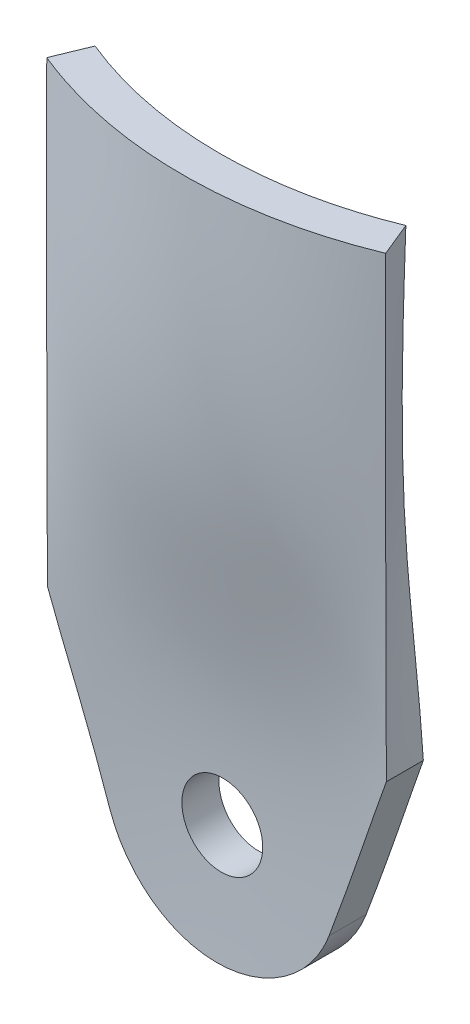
ISO-10303-21;
HEADER;
FILE_DESCRIPTION(('STEP AP214'),'2;1');
FILE_NAME('part.step','',(''),(''),'','','');
FILE_SCHEMA(('AUTOMOTIVE_DESIGN { 1 0 10303 214 1 1 1 1 }'));
ENDSEC;
DATA;
#1=APPLICATION_CONTEXT('core data for automotive mechanical design processes');
#2=APPLICATION_PROTOCOL_DEFINITION('international standard','automotive_design',2000,#1);
#3=PRODUCT_CONTEXT('',#1,'mechanical');
#4=PRODUCT('Part','Part','',(#3));
#5=PRODUCT_RELATED_PRODUCT_CATEGORY('part','',(#4));
#6=PRODUCT_DEFINITION_FORMATION('','',#4);
#7=PRODUCT_DEFINITION_CONTEXT('part definition',#1,'design');
#8=PRODUCT_DEFINITION('design','',#6,#7);
#9=PRODUCT_DEFINITION_SHAPE('','',#8);
#10=(LENGTH_UNIT() NAMED_UNIT(*) SI_UNIT(.MILLI.,.METRE.));
#11=(NAMED_UNIT(*) PLANE_ANGLE_UNIT() SI_UNIT($,.RADIAN.));
#12=(NAMED_UNIT(*) SI_UNIT($,.STERADIAN.) SOLID_ANGLE_UNIT());
#13=UNCERTAINTY_MEASURE_WITH_UNIT(LENGTH_MEASURE(1.E-05),#10,'distance_accuracy_value','');
#14=(GEOMETRIC_REPRESENTATION_CONTEXT(3) GLOBAL_UNCERTAINTY_ASSIGNED_CONTEXT((#13)) GLOBAL_UNIT_ASSIGNED_CONTEXT((#10,
#11,#12)) REPRESENTATION_CONTEXT('',''));
#15=CARTESIAN_POINT('',(0.,0.,0.));
#16=DIRECTION('',(0.,0.,1.));
#17=DIRECTION('',(1.,0.,0.));
#18=AXIS2_PLACEMENT_3D('',#15,#16,#17);
#19=CARTESIAN_POINT('',(27.6985551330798,44.45,6.14951913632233));
#20=CARTESIAN_POINT('',(27.6985551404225,29.6048120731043,6.16863058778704));
#21=CARTESIAN_POINT('',(27.6985551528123,4.55568615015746,6.20087842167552));
#22=CARTESIAN_POINT('',(27.698555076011,-33.2978883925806,6.00098125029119));
#23=CARTESIAN_POINT('',(27.6985550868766,-56.6753209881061,6.0292619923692));
#24=CARTESIAN_POINT('',(27.698555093,-69.85,6.0452));
#25=CARTESIAN_POINT('',(9.95387424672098,44.45,13.4444482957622));
#26=CARTESIAN_POINT('',(10.0859668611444,29.6048120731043,14.8000037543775));
#27=CARTESIAN_POINT('',(10.3088542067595,4.55568615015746,17.0873092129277));
#28=CARTESIAN_POINT('',(8.92722497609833,-33.2978883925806,2.90880988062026));
#29=CARTESIAN_POINT('',(9.12269297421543,-56.6753209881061,4.91473362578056));
#30=CARTESIAN_POINT('',(9.23285169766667,-69.85,6.0452));
#31=CARTESIAN_POINT('',(-9.95387424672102,44.45,13.4444482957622));
#32=CARTESIAN_POINT('',(-10.0859668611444,29.6048120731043,14.8000037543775));
#33=CARTESIAN_POINT('',(-10.3088542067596,4.55568615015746,17.0873092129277));
#34=CARTESIAN_POINT('',(-8.92722497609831,-33.2978883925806,2.90880988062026));
#35=CARTESIAN_POINT('',(-9.12269297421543,-56.6753209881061,4.91473362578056));
#36=CARTESIAN_POINT('',(-9.23285169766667,-69.85,6.0452));
#37=CARTESIAN_POINT('',(-27.6985551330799,44.45,6.14951913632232));
#38=CARTESIAN_POINT('',(-27.6985551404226,29.6048120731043,6.16863058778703));
#39=CARTESIAN_POINT('',(-27.6985551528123,4.55568615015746,6.2008784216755));
#40=CARTESIAN_POINT('',(-27.698555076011,-33.2978883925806,6.0009812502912));
#41=CARTESIAN_POINT('',(-27.6985550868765,-56.6753209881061,6.0292619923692));
#42=CARTESIAN_POINT('',(-27.698555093,-69.85,6.0452));
#43=B_SPLINE_SURFACE_WITH_KNOTS('',3,3,((#19,#20,#21,#22,#23,#24),(#25,#26,#27,#28,#29,#30),
(#31,#32,#33,#34,#35,#36),(#37,#38,#39,#40,#41,#42)),.UNSPECIFIED.,.F.,.F.,.F.,(4,4),(4,1,1,4),
(0.,1.),(0.,0.388359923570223,0.655301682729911,1.),.UNSPECIFIED.);
#44=CARTESIAN_POINT('',(-6.604,-50.8,5.15255429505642));
#45=CARTESIAN_POINT('',(-6.60400134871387,-50.6144790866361,5.14912651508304));
#46=CARTESIAN_POINT('',(-6.59617927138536,-50.4289783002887,5.14580467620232));
#47=CARTESIAN_POINT('',(-6.5649445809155,-50.0592290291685,5.13939822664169));
#48=CARTESIAN_POINT('',(-6.54152788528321,-49.8749808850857,5.13631367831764));
#49=CARTESIAN_POINT('',(-6.47923588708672,-49.5089471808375,5.13040374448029));
#50=CARTESIAN_POINT('',(-6.44034689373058,-49.3271639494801,5.12757859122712));
#51=CARTESIAN_POINT('',(-6.3473695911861,-48.96745088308,5.12220804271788));
#52=CARTESIAN_POINT('',(-6.29327573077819,-48.7895224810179,5.11966275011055));
#53=CARTESIAN_POINT('',(-6.17033014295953,-48.4390026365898,5.11486822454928));
#54=CARTESIAN_POINT('',(-6.10149076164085,-48.2664068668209,5.11261874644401));
#55=CARTESIAN_POINT('',(-5.94948806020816,-47.9275619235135,5.10841938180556));
#56=CARTESIAN_POINT('',(-5.86631946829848,-47.7613151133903,5.10646960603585));
#57=CARTESIAN_POINT('',(-5.68632264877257,-47.4365193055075,5.10287164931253));
#58=CARTESIAN_POINT('',(-5.5895028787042,-47.277965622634,5.10122328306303));
#59=CARTESIAN_POINT('',(-5.38281445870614,-46.9695166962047,5.09821863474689));
#60=CARTESIAN_POINT('',(-5.27294100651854,-46.819624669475,5.0968624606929));
#61=CARTESIAN_POINT('',(-5.04100221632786,-46.5296881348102,5.09442848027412));
#62=CARTESIAN_POINT('',(-4.91894184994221,-46.3896396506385,5.0933505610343));
#63=CARTESIAN_POINT('',(-4.66341202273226,-46.1202691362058,5.09144985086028));
#64=CARTESIAN_POINT('',(-4.52993836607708,-45.9909510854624,5.09062715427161));
#65=CARTESIAN_POINT('',(-4.25261583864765,-45.7440600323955,5.0892090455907));
#66=CARTESIAN_POINT('',(-4.1087704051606,-45.6264831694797,5.08861355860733));
#67=CARTESIAN_POINT('',(-3.81163275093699,-45.4038206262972,5.08761557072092));
#68=CARTESIAN_POINT('',(-3.6583370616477,-45.298739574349,5.08721314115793));
#69=CARTESIAN_POINT('',(-3.34349968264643,-45.1019057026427,5.08656456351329));
#70=CARTESIAN_POINT('',(-3.18196129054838,-45.0101476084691,5.08631835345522));
#71=CARTESIAN_POINT('',(-2.85166968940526,-44.8405306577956,5.08594351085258));
#72=CARTESIAN_POINT('',(-2.68291383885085,-44.7626769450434,5.08581492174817));
#73=CARTESIAN_POINT('',(-2.33950569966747,-44.6214904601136,5.0856381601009));
#74=CARTESIAN_POINT('',(-2.16485562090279,-44.5581523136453,5.08558995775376));
#75=CARTESIAN_POINT('',(-1.81077986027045,-44.4463887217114,5.08554010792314));
#76=CARTESIAN_POINT('',(-1.63135243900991,-44.3979687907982,5.08553847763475));
#77=CARTESIAN_POINT('',(-1.26909599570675,-44.316432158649,5.08555358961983));
#78=CARTESIAN_POINT('',(-1.08626799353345,-44.2833109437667,5.08557032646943));
#79=CARTESIAN_POINT('',(-0.718455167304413,-44.2325674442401,5.08560242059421));
#80=CARTESIAN_POINT('',(-0.533469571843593,-44.2149508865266,5.08561777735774));
#81=CARTESIAN_POINT('',(0.0226147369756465,-44.1856414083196,5.0856416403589));
#82=CARTESIAN_POINT('',(0.395235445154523,-44.1974002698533,5.08562802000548));
#83=CARTESIAN_POINT('',(1.13301612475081,-44.2833119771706,5.08556818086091));
#84=CARTESIAN_POINT('',(1.498175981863,-44.3574657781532,5.0855219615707));
#85=CARTESIAN_POINT('',(2.21091847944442,-44.5660251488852,5.08557905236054));
#86=CARTESIAN_POINT('',(2.55850109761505,-44.7004307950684,5.08568236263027));
#87=CARTESIAN_POINT('',(3.22615232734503,-45.025688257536,5.08631995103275));
#88=CARTESIAN_POINT('',(3.54622101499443,-45.2165399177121,5.08685422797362));
#89=CARTESIAN_POINT('',(4.14977671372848,-45.6492678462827,5.08866264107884));
#90=CARTESIAN_POINT('',(4.43326376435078,-45.8911440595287,5.08993677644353));
#91=CARTESIAN_POINT('',(4.95558874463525,-46.4190382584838,5.09348733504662));
#92=CARTESIAN_POINT('',(5.19442912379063,-46.7050538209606,5.09576370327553));
#93=CARTESIAN_POINT('',(5.62070221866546,-47.3131127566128,5.10148281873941));
#94=CARTESIAN_POINT('',(5.80813495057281,-47.6351561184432,5.10492556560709));
#95=CARTESIAN_POINT('',(6.12626803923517,-48.3061082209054,5.11302185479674));
#96=CARTESIAN_POINT('',(6.25697106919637,-48.6550156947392,5.11767534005));
#97=CARTESIAN_POINT('',(6.45795496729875,-49.3698032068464,5.12812501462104));
#98=CARTESIAN_POINT('',(6.52823579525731,-49.735683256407,5.13392120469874));
#99=CARTESIAN_POINT('',(6.6063943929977,-50.474081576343,5.1464980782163));
#100=CARTESIAN_POINT('',(6.61426381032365,-50.8466007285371,5.15327889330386));
#101=CARTESIAN_POINT('',(6.56736253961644,-51.5876598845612,5.16759707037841));
#102=CARTESIAN_POINT('',(6.51259175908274,-51.9561998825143,5.17513443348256));
#103=CARTESIAN_POINT('',(6.34194760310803,-52.6789412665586,5.19068631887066));
#104=CARTESIAN_POINT('',(6.22605849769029,-53.0331389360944,5.19870096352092));
#105=CARTESIAN_POINT('',(5.9364597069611,-53.7170469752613,5.21487513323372));
#106=CARTESIAN_POINT('',(5.76274994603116,-54.046757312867,5.22303465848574));
#107=CARTESIAN_POINT('',(5.36240096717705,-54.6723915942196,5.2391232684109));
#108=CARTESIAN_POINT('',(5.13575258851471,-54.9683096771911,5.24705231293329));
#109=CARTESIAN_POINT('',(4.63597562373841,-55.5178926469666,5.26226501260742));
#110=CARTESIAN_POINT('',(4.36284701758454,-55.7715575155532,5.26954866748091));
#111=CARTESIAN_POINT('',(3.77786573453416,-56.2294068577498,5.28304324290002));
#112=CARTESIAN_POINT('',(3.46601669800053,-56.4335959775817,5.28925426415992));
#113=CARTESIAN_POINT('',(2.81249278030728,-56.7867130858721,5.30020243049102));
#114=CARTESIAN_POINT('',(2.47081800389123,-56.9356412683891,5.30493958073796));
#115=CARTESIAN_POINT('',(1.76723062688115,-57.1739633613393,5.312607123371));
#116=CARTESIAN_POINT('',(1.40532627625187,-57.2633813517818,5.31553824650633));
#117=CARTESIAN_POINT('',(0.85542876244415,-57.3510076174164,5.31842208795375));
#118=CARTESIAN_POINT('',(0.670855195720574,-57.3724652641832,5.3191312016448));
#119=CARTESIAN_POINT('',(0.30057390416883,-57.3997627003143,5.32003406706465));
#120=CARTESIAN_POINT('',(0.114866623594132,-57.4056082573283,5.32022800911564));
#121=CARTESIAN_POINT('',(-0.25635672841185,-57.401633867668,5.32009637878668));
#122=CARTESIAN_POINT('',(-0.441872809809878,-57.39181478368,5.31977083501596));
#123=CARTESIAN_POINT('',(-0.811352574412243,-57.3565953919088,5.31860693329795));
#124=CARTESIAN_POINT('',(-0.995316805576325,-57.3312008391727,5.31776876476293));
#125=CARTESIAN_POINT('',(-1.36051827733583,-57.2650026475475,5.31559501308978));
#126=CARTESIAN_POINT('',(-1.54175448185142,-57.224193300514,5.31425924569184));
#127=CARTESIAN_POINT('',(-1.90007647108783,-57.1274757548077,5.31111564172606));
#128=CARTESIAN_POINT('',(-2.07716376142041,-57.0715731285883,5.30930797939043));
#129=CARTESIAN_POINT('',(-2.42606649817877,-56.9450359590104,5.30525229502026));
#130=CARTESIAN_POINT('',(-2.59787988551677,-56.8743957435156,5.30300410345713));
#131=CARTESIAN_POINT('',(-2.93488055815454,-56.7189284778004,5.2981083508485));
#132=CARTESIAN_POINT('',(-3.1000702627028,-56.6341066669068,5.29546093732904));
#133=CARTESIAN_POINT('',(-3.42277199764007,-56.4508309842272,5.28981029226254));
#134=CARTESIAN_POINT('',(-3.5802814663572,-56.3523726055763,5.28680694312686));
#135=CARTESIAN_POINT('',(-3.88638962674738,-56.1425843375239,5.28049548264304));
#136=CARTESIAN_POINT('',(-4.03499157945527,-56.0312592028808,5.2771874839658));
#137=CARTESIAN_POINT('',(-4.32239255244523,-55.7964186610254,5.27031514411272));
#138=CARTESIAN_POINT('',(-4.46118479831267,-55.6728949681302,5.26675062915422));
#139=CARTESIAN_POINT('',(-4.72782009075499,-55.4146470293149,5.25942163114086));
#140=CARTESIAN_POINT('',(-4.85566715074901,-55.2799269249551,5.25565722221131));
#141=CARTESIAN_POINT('',(-5.09963826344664,-55.000116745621,5.2479777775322));
#142=CARTESIAN_POINT('',(-5.21575501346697,-54.855020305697,5.24406265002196));
#143=CARTESIAN_POINT('',(-5.43531035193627,-54.5556179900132,5.23613739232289));
#144=CARTESIAN_POINT('',(-5.53875359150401,-54.4013155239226,5.23212729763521));
#145=CARTESIAN_POINT('',(-5.73239885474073,-54.0843497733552,5.22405572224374));
#146=CARTESIAN_POINT('',(-5.82258416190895,-53.9216762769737,5.21999418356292));
#147=CARTESIAN_POINT('',(-5.98888672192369,-53.5893658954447,5.21187400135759));
#148=CARTESIAN_POINT('',(-6.06500910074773,-53.419731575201,5.20781535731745));
#149=CARTESIAN_POINT('',(-6.20262432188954,-53.0747994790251,5.19974803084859));
#150=CARTESIAN_POINT('',(-6.26413008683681,-52.8995068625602,5.19573930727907));
#151=CARTESIAN_POINT('',(-6.37214628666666,-52.5444212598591,5.18781148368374));
#152=CARTESIAN_POINT('',(-6.41866064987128,-52.364629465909,5.1838923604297));
#153=CARTESIAN_POINT('',(-6.50616185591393,-51.9561047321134,5.17521122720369));
#154=CARTESIAN_POINT('',(-6.54281945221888,-51.72643093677,5.17048500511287));
#155=CARTESIAN_POINT('',(-6.59173768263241,-51.264494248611,5.16130195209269));
#156=CARTESIAN_POINT('',(-6.60399831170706,-51.0322313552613,5.15684512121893));
#157=CARTESIAN_POINT('',(-6.604,-50.8,5.15255429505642));
#158=B_SPLINE_CURVE_WITH_KNOTS('',3,(#44,#45,#46,#47,#48,#49,#50,#51,#52,#53,#54,#55,#56,#57,
#58,#59,#60,#61,#62,#63,#64,#65,#66,#67,#68,#69,#70,#71,#72,#73,#74,#75,#76,#77,#78,#79,#80,#81,
#82,#83,#84,#85,#86,#87,#88,#89,#90,#91,#92,#93,#94,#95,#96,#97,#98,#99,#100,#101,#102,#103,
#104,#105,#106,#107,#108,#109,#110,#111,#112,#113,#114,#115,#116,#117,#118,#119,#120,#121,#122,
#123,#124,#125,#126,#127,#128,#129,#130,#131,#132,#133,#134,#135,#136,#137,#138,#139,#140,#141,
#142,#143,#144,#145,#146,#147,#148,#149,#150,#151,#152,#153,#154,#155,#156,#157),.UNSPECIFIED.,
.T.,.F.,(4,2,2,2,2,2,2,2,2,2,2,2,2,2,2,2,2,2,2,2,2,2,2,2,2,2,2,2,2,2,2,2,2,2,2,2,2,2,2,2,2,2,2,
2,2,2,2,2,2,2,2,2,2,2,2,2,4),(0.,0.55645496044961,1.11305565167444,1.67014995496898,
2.22744791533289,2.78428107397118,3.34131953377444,3.89801438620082,4.45491467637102,
5.01158870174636,5.56846826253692,6.1251641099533,6.68206551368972,7.23874584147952,
7.79563168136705,8.35231100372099,8.90919585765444,9.46591630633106,10.0228423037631,
11.135496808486,12.2481683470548,13.3608412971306,14.4735111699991,15.5861798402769,
16.6987874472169,17.8113947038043,18.9239495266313,20.0365050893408,21.1492095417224,
22.2619156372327,23.374908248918,24.4879023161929,25.6010891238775,26.7142764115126,
27.8273591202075,28.9404379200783,30.0530660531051,30.6099778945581,31.1666839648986,
31.7233593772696,32.2798292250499,32.836505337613,33.3929762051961,33.9496616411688,
34.50614186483,35.0628064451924,35.6192659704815,36.1761060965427,36.7327411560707,
37.2897206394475,37.8464950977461,38.4039656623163,38.9612326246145,39.5180050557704,
40.0746314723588,40.7711904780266,41.4677496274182),.UNSPECIFIED.);
#159=CARTESIAN_POINT('',(-6.604,-50.8,5.15255429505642));
#160=VERTEX_POINT('',#159);
#161=EDGE_CURVE('E485',#160,#160,#158,.T.);
#162=CARTESIAN_POINT('',(-27.6985551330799,44.45,6.14951913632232));
#163=CARTESIAN_POINT('',(-27.6985551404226,29.6048120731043,6.16863058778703));
#164=CARTESIAN_POINT('',(-27.6985551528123,4.55568615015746,6.2008784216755));
#165=CARTESIAN_POINT('',(-27.698555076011,-33.2978883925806,6.0009812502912));
#166=CARTESIAN_POINT('',(-27.6985550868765,-56.6753209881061,6.0292619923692));
#167=CARTESIAN_POINT('',(-27.698555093,-69.85,6.0452));
#168=B_SPLINE_CURVE_WITH_KNOTS('',3,(#162,#163,#164,#165,#166,#167),.UNSPECIFIED.,.F.,.F.,(4,1,
1,4),(0.,0.388359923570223,0.655301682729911,1.),.UNSPECIFIED.);
#169=CARTESIAN_POINT('',(-27.6985551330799,44.45,6.14951913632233));
#170=VERTEX_POINT('',#169);
#171=CARTESIAN_POINT('',(-27.698555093,-30.397318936,6.0452));
#172=VERTEX_POINT('',#171);
#173=EDGE_CURVE('E484',#170,#172,#168,.T.);
#174=CARTESIAN_POINT('',(-27.6985550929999,-30.3973190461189,6.04519999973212));
#175=CARTESIAN_POINT('',(-27.535219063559,-30.8460811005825,6.04409830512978));
#176=CARTESIAN_POINT('',(-27.3718863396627,-31.2948340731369,6.04104698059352));
#177=CARTESIAN_POINT('',(-27.0452344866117,-32.192302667,6.03171683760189));
#178=CARTESIAN_POINT('',(-26.8819153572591,-32.6410182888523,6.02543807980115));
#179=CARTESIAN_POINT('',(-26.5553072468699,-33.5383667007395,6.01032547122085));
#180=CARTESIAN_POINT('',(-26.3920182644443,-33.9869994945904,6.00149186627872));
#181=CARTESIAN_POINT('',(-26.0654533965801,-34.8842290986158,5.98186895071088));
#182=CARTESIAN_POINT('',(-25.9021775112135,-35.3328259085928,5.97107962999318));
#183=CARTESIAN_POINT('',(-25.4123736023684,-36.6785510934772,5.93662664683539));
#184=CARTESIAN_POINT('',(-25.0858631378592,-37.5756312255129,5.91087763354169));
#185=CARTESIAN_POINT('',(-24.4328630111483,-39.3697343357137,5.85770787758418));
#186=CARTESIAN_POINT('',(-24.1063733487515,-40.2667573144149,5.83028715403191));
#187=CARTESIAN_POINT('',(-23.4533883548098,-42.0608188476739,5.77694412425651));
#188=CARTESIAN_POINT('',(-23.1268930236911,-42.9578574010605,5.75102177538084));
#189=CARTESIAN_POINT('',(-22.4738342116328,-44.752121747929,5.70321562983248));
#190=CARTESIAN_POINT('',(-22.1472707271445,-45.6493475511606,5.68133223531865));
#191=CARTESIAN_POINT('',(-21.4941187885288,-47.4438677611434,5.64356456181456));
#192=CARTESIAN_POINT('',(-21.1675303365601,-48.3411621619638,5.62767997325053));
#193=CARTESIAN_POINT('',(-20.5143254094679,-50.13582795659,5.60331765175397));
#194=CARTESIAN_POINT('',(-20.1877089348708,-51.0331993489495,5.59483980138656));
#195=CARTESIAN_POINT('',(-19.5344457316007,-52.8280252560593,5.58619040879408));
#196=CARTESIAN_POINT('',(-19.2077990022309,-53.7254797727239,5.58601927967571));
#197=CARTESIAN_POINT('',(-18.7178181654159,-55.0716910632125,5.59230238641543));
#198=CARTESIAN_POINT('',(-18.5544785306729,-55.5204630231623,5.5954871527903));
#199=CARTESIAN_POINT('',(-18.2278057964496,-56.4179889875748,5.60403813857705));
#200=CARTESIAN_POINT('',(-18.0644726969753,-56.8667429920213,5.60940435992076));
#201=CARTESIAN_POINT('',(-17.9011444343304,-57.3154837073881,5.61586182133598));
#202=B_SPLINE_CURVE_WITH_KNOTS('',3,(#174,#175,#176,#177,#178,#179,#180,#181,#182,#183,#184,
#185,#186,#187,#188,#189,#190,#191,#192,#193,#194,#195,#196,#197,#198,#199,#200,#201),
.UNSPECIFIED.,.F.,.F.,(4,2,2,2,2,2,2,2,2,2,2,2,2,4),(0.,1.4326802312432,2.86533353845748,
4.29784903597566,5.73037192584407,8.59536341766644,11.4603221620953,14.325199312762,
17.1903615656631,20.0553759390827,22.9203448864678,25.7854563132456,27.2182032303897,
28.6509514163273),.UNSPECIFIED.);
#203=CARTESIAN_POINT('',(-17.9011444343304,-57.3154837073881,5.61586182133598));
#204=VERTEX_POINT('',#203);
#205=EDGE_CURVE('E421',#172,#204,#202,.T.);
#206=CARTESIAN_POINT('',(-17.9011444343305,-57.3154837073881,5.61586182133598));
#207=CARTESIAN_POINT('',(-17.778978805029,-57.6511643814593,5.62068689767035));
#208=CARTESIAN_POINT('',(-17.6473517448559,-57.9833970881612,5.62571730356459));
#209=CARTESIAN_POINT('',(-17.3656456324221,-58.6399186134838,5.63624630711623));
#210=CARTESIAN_POINT('',(-17.2155674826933,-58.9642078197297,5.64174488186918));
#211=CARTESIAN_POINT('',(-16.8974207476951,-59.6038219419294,5.65326811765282));
#212=CARTESIAN_POINT('',(-16.7293524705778,-59.9191470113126,5.65929276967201));
#213=CARTESIAN_POINT('',(-16.3758910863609,-60.539613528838,5.67189565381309));
#214=CARTESIAN_POINT('',(-16.1905107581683,-60.8447622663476,5.67847347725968));
#215=CARTESIAN_POINT('',(-15.8029053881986,-61.4441556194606,5.69219472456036));
#216=CARTESIAN_POINT('',(-15.6006805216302,-61.7384003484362,5.69933814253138));
#217=CARTESIAN_POINT('',(-15.180043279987,-62.3150413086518,5.71416961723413));
#218=CARTESIAN_POINT('',(-14.9616309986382,-62.59743760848,5.72185767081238));
#219=CARTESIAN_POINT('',(-14.3960713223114,-63.2876841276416,5.74170647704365));
#220=CARTESIAN_POINT('',(-14.0391903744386,-63.6876081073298,5.75418045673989));
#221=CARTESIAN_POINT('',(-13.2929524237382,-64.4560157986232,5.77998008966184));
#222=CARTESIAN_POINT('',(-12.9035911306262,-64.8244953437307,5.79330585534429));
#223=CARTESIAN_POINT('',(-12.2974366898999,-65.351539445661,5.81362549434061));
#224=CARTESIAN_POINT('',(-12.0916867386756,-65.5229511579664,5.82045429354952));
#225=CARTESIAN_POINT('',(-11.6732077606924,-65.8569042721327,5.83416133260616));
#226=CARTESIAN_POINT('',(-11.4604807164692,-66.0194481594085,5.84103955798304));
#227=CARTESIAN_POINT('',(-10.8122592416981,-66.4934385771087,5.86165896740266));
#228=CARTESIAN_POINT('',(-10.36668988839,-66.7912739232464,5.87538606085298));
#229=CARTESIAN_POINT('',(-9.45188619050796,-67.3484562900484,5.90225788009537));
#230=CARTESIAN_POINT('',(-8.98264111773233,-67.6077856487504,5.9154023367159));
#231=CARTESIAN_POINT('',(-8.02392731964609,-68.0860060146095,5.94054632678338));
#232=CARTESIAN_POINT('',(-7.53445855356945,-68.3048969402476,5.95254585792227));
#233=CARTESIAN_POINT('',(-6.53871814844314,-68.7006915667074,5.97487011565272));
#234=CARTESIAN_POINT('',(-6.03244417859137,-68.8775894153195,5.98519460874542));
#235=CARTESIAN_POINT('',(-5.0067511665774,-69.1880953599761,6.00369802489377));
#236=CARTESIAN_POINT('',(-4.48733214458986,-69.3217035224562,6.01187695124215));
#237=CARTESIAN_POINT('',(-3.43946499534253,-69.5445799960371,6.02570662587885));
#238=CARTESIAN_POINT('',(-2.91102436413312,-69.6338834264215,6.0313593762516));
#239=CARTESIAN_POINT('',(-1.84847661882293,-69.767666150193,6.03988379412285));
#240=CARTESIAN_POINT('',(-1.31436950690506,-69.812145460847,6.04275546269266));
#241=CARTESIAN_POINT('',(-0.24433393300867,-69.8559572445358,6.04558375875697));
#242=CARTESIAN_POINT('',(0.291594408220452,-69.8552926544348,6.04554057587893));
#243=CARTESIAN_POINT('',(1.36148227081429,-69.8088287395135,6.04254165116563));
#244=CARTESIAN_POINT('',(1.895441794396,-69.7630294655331,6.03958591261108));
#245=CARTESIAN_POINT('',(2.95669301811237,-69.6267414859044,6.03090694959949));
#246=CARTESIAN_POINT('',(3.48399439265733,-69.5363277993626,6.02518837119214));
#247=CARTESIAN_POINT('',(4.52909626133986,-69.311496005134,6.01125028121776));
#248=CARTESIAN_POINT('',(5.04689676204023,-69.1770779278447,6.00303077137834));
#249=CARTESIAN_POINT('',(6.06931145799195,-68.8652040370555,5.98446807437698));
#250=CARTESIAN_POINT('',(6.57392610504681,-68.6877497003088,5.97412496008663));
#251=CARTESIAN_POINT('',(7.56641896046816,-68.2910665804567,5.95178199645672));
#252=CARTESIAN_POINT('',(8.05429717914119,-68.0718378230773,5.93978214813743));
#253=CARTESIAN_POINT('',(9.01031755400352,-67.5929375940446,5.91464208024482));
#254=CARTESIAN_POINT('',(9.47844123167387,-67.3332292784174,5.90150082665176));
#255=CARTESIAN_POINT('',(10.3911584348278,-66.7753697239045,5.87464298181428));
#256=CARTESIAN_POINT('',(10.8357517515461,-66.4772181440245,5.86092638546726));
#257=CARTESIAN_POINT('',(11.6984984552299,-65.8443958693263,5.8334528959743));
#258=CARTESIAN_POINT('',(12.116641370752,-65.5097108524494,5.81969598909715));
#259=CARTESIAN_POINT('',(12.7214956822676,-64.9823013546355,5.79940479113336));
#260=CARTESIAN_POINT('',(12.9193926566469,-64.8022621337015,5.79269822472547));
#261=CARTESIAN_POINT('',(13.3074861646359,-64.4339609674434,5.77944777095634));
#262=CARTESIAN_POINT('',(13.4976806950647,-64.2456969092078,5.77290392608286));
#263=CARTESIAN_POINT('',(14.0568471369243,-63.668368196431,5.75356586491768));
#264=CARTESIAN_POINT('',(14.4136724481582,-63.2674030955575,5.741089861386));
#265=CARTESIAN_POINT('',(15.0922312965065,-62.4367800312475,5.71727299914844));
#266=CARTESIAN_POINT('',(15.413965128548,-62.0071223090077,5.70593213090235));
#267=CARTESIAN_POINT('',(15.8682700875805,-61.3438252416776,5.68988078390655));
#268=CARTESIAN_POINT('',(16.0149114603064,-61.1197279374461,5.68469308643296));
#269=CARTESIAN_POINT('',(16.2985878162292,-60.6656074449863,5.67463613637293));
#270=CARTESIAN_POINT('',(16.4356249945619,-60.4355856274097,5.6697668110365));
#271=CARTESIAN_POINT('',(16.831896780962,-59.7373328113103,5.65563424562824));
#272=CARTESIAN_POINT('',(17.076489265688,-59.2606258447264,5.64683946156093));
#273=CARTESIAN_POINT('',(17.410722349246,-58.535544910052,5.63456137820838));
#274=CARTESIAN_POINT('',(17.5159527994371,-58.2942128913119,5.6306496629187));
#275=CARTESIAN_POINT('',(17.7161804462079,-57.8077451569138,5.62307716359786));
#276=CARTESIAN_POINT('',(17.8111922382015,-57.5626154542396,5.619416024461));
#277=CARTESIAN_POINT('',(17.9011082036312,-57.3155832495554,5.61586325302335));
#278=B_SPLINE_CURVE_WITH_KNOTS('',3,(#206,#207,#208,#209,#210,#211,#212,#213,#214,#215,#216,
#217,#218,#219,#220,#221,#222,#223,#224,#225,#226,#227,#228,#229,#230,#231,#232,#233,#234,#235,
#236,#237,#238,#239,#240,#241,#242,#243,#244,#245,#246,#247,#248,#249,#250,#251,#252,#253,#254,
#255,#256,#257,#258,#259,#260,#261,#262,#263,#264,#265,#266,#267,#268,#269,#270,#271,#272,#273,
#274,#275,#276,#277),.UNSPECIFIED.,.F.,.F.,(4,2,2,2,2,2,2,2,2,2,2,2,2,2,2,2,2,2,2,2,2,2,2,2,2,2,
2,2,2,2,2,2,2,2,2,4),(0.,1.07161350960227,2.14317462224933,3.21471738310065,4.28547534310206,
5.35622216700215,6.42696279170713,8.03344276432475,9.64013527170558,10.4435782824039,
11.2467949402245,12.8530911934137,14.4601219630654,16.0671559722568,17.6744138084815,
19.2816691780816,20.8876484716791,22.4936271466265,24.0995013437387,25.7053737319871,
27.3085550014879,28.911735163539,30.5148603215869,32.1179844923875,33.72257641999,
35.3271825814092,36.932420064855,37.7350865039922,38.5379603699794,40.1466031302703,
41.7552323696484,42.5586061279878,43.3617956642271,44.967128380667,45.7568630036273,
46.5454542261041),.UNSPECIFIED.);
#279=CARTESIAN_POINT('',(17.9011082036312,-57.3155832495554,5.61586325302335));
#280=VERTEX_POINT('',#279);
#281=EDGE_CURVE('E605',#204,#280,#278,.T.);
#282=CARTESIAN_POINT('',(17.9011082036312,-57.3155832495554,5.61586325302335));
#283=CARTESIAN_POINT('',(18.0644370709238,-56.8668486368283,5.60940581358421));
#284=CARTESIAN_POINT('',(18.2277707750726,-56.4181007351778,5.60403959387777));
#285=CARTESIAN_POINT('',(18.5544447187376,-55.5205869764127,5.59548857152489));
#286=CARTESIAN_POINT('',(18.717784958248,-55.0718211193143,5.59230376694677));
#287=CARTESIAN_POINT('',(19.2077676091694,-53.7256281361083,5.5860204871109));
#288=CARTESIAN_POINT('',(19.534415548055,-52.8281858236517,5.58619142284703));
#289=CARTESIAN_POINT('',(20.1876811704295,-51.0333843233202,5.59484029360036));
#290=CARTESIAN_POINT('',(20.514298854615,-50.1360251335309,5.60331781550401));
#291=CARTESIAN_POINT('',(21.1675062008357,-48.3413837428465,5.62767938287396));
#292=CARTESIAN_POINT('',(21.4940958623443,-47.4441015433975,5.64356354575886));
#293=CARTESIAN_POINT('',(22.1472502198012,-45.6496057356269,5.68133032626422));
#294=CARTESIAN_POINT('',(22.4738149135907,-44.7523921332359,5.70321325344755));
#295=CARTESIAN_POINT('',(23.1268761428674,-42.9581521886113,5.75101849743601));
#296=CARTESIAN_POINT('',(23.4533726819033,-42.0611258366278,5.77694041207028));
#297=CARTESIAN_POINT('',(24.1063600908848,-40.2670887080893,5.8302827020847));
#298=CARTESIAN_POINT('',(24.4328509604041,-39.3700779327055,5.85770312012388));
#299=CARTESIAN_POINT('',(25.0858535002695,-37.575999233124,5.91087251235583));
#300=CARTESIAN_POINT('',(25.4123651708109,-36.6789313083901,5.93662146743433));
#301=CARTESIAN_POINT('',(25.9021708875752,-35.3332244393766,5.97107465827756));
#302=CARTESIAN_POINT('',(26.0654473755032,-34.8846337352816,5.98186409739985));
#303=CARTESIAN_POINT('',(26.3920134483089,-33.9874163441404,6.00148736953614));
#304=CARTESIAN_POINT('',(26.5553030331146,-33.538789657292,6.0103212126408));
#305=CARTESIAN_POINT('',(26.881912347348,-32.6414534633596,6.02543444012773));
#306=CARTESIAN_POINT('',(27.0452320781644,-32.1927439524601,6.03171357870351));
#307=CARTESIAN_POINT('',(27.3718851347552,-31.2952875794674,6.04104465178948));
#308=CARTESIAN_POINT('',(27.5352184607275,-30.8465407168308,6.0440965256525));
#309=CARTESIAN_POINT('',(27.6985550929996,-30.3977847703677,6.04519886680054));
#310=B_SPLINE_CURVE_WITH_KNOTS('',3,(#282,#283,#284,#285,#286,#287,#288,#289,#290,#291,#292,
#293,#294,#295,#296,#297,#298,#299,#300,#301,#302,#303,#304,#305,#306,#307,#308,#309),
.UNSPECIFIED.,.F.,.F.,(4,2,2,2,2,2,2,2,2,2,2,2,2,4),(0.,1.43273160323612,2.8654619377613,
5.73054020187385,8.59547598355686,11.4604571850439,14.3255862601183,17.1904302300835,
20.055355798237,22.9203141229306,24.3528204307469,25.7853193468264,27.2179560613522,
28.6506196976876),.UNSPECIFIED.);
#311=CARTESIAN_POINT('',(27.6985550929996,-30.3977847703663,6.04519886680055));
#312=VERTEX_POINT('',#311);
#313=EDGE_CURVE('E603',#280,#312,#310,.T.);
#314=CARTESIAN_POINT('',(27.6985551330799,44.45,6.14951913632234));
#315=CARTESIAN_POINT('',(27.6985551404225,29.6048120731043,6.16863058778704));
#316=CARTESIAN_POINT('',(27.6985551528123,4.55568615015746,6.20087842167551));
#317=CARTESIAN_POINT('',(27.698555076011,-33.2978883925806,6.0009812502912));
#318=CARTESIAN_POINT('',(27.6985550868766,-56.6753209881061,6.0292619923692));
#319=CARTESIAN_POINT('',(27.698555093,-69.85,6.0452));
#320=B_SPLINE_CURVE_WITH_KNOTS('',3,(#314,#315,#316,#317,#318,#319),.UNSPECIFIED.,.F.,.F.,(4,1,
1,4),(0.,0.388359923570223,0.655301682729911,1.),.UNSPECIFIED.);
#321=CARTESIAN_POINT('',(27.6985551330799,44.45,6.14951913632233));
#322=VERTEX_POINT('',#321);
#323=EDGE_CURVE('E633',#322,#312,#320,.T.);
#324=CARTESIAN_POINT('',(27.6985551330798,44.45,6.14951913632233));
#325=CARTESIAN_POINT('',(9.95387424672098,44.45,13.4444482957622));
#326=CARTESIAN_POINT('',(-9.95387424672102,44.45,13.4444482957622));
#327=CARTESIAN_POINT('',(-27.6985551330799,44.45,6.14951913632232));
#328=B_SPLINE_CURVE_WITH_KNOTS('',3,(#324,#325,#326,#327),.UNSPECIFIED.,.F.,.F.,(4,4),(0.,1.),.UNSPECIFIED.);
#329=EDGE_CURVE('E653',#170,#322,#328,.F.);
#330=ORIENTED_EDGE('',*,*,#161,.T.);
#331=EDGE_LOOP('',(#330));
#332=FACE_BOUND('',#331,.T.);
#333=ORIENTED_EDGE('',*,*,#173,.T.);
#334=ORIENTED_EDGE('',*,*,#205,.T.);
#335=ORIENTED_EDGE('',*,*,#281,.T.);
#336=ORIENTED_EDGE('',*,*,#313,.T.);
#337=ORIENTED_EDGE('',*,*,#323,.F.);
#338=ORIENTED_EDGE('',*,*,#329,.F.);
#339=EDGE_LOOP('',(#333,#334,#335,#336,#337,#338));
#340=FACE_BOUND('',#339,.T.);
#341=ADVANCED_FACE('F403',(#332,#340),#43,.T.);
#342=CARTESIAN_POINT('',(-25.4,44.45,0.558357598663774));
#343=CARTESIAN_POINT('',(-24.9789006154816,29.6048120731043,0.660649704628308));
#344=CARTESIAN_POINT('',(-24.2683557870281,4.55568615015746,0.833252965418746));
#345=CARTESIAN_POINT('',(-28.6728656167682,-33.2978883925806,-0.236676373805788));
#346=CARTESIAN_POINT('',(-28.0497312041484,-56.6753209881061,-0.0853065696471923));
#347=CARTESIAN_POINT('',(-27.698555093,-69.85,0.));
#348=CARTESIAN_POINT('',(-9.12785539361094,44.45,7.24791955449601));
#349=CARTESIAN_POINT('',(-9.1086198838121,29.6048120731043,8.57575131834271));
#350=CARTESIAN_POINT('',(-9.07616271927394,4.55568615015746,10.816277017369));
#351=CARTESIAN_POINT('',(-9.27735748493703,-33.2978883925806,-3.07224495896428));
#352=CARTESIAN_POINT('',(-9.24889316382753,-56.6753209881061,-1.10734618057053));
#353=CARTESIAN_POINT('',(-9.23285169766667,-69.85,0.));
#354=CARTESIAN_POINT('',(9.12785539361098,44.45,7.24791955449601));
#355=CARTESIAN_POINT('',(9.10861988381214,29.6048120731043,8.57575131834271));
#356=CARTESIAN_POINT('',(9.07616271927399,4.55568615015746,10.816277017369));
#357=CARTESIAN_POINT('',(9.27735748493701,-33.2978883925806,-3.07224495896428));
#358=CARTESIAN_POINT('',(9.24889316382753,-56.6753209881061,-1.10734618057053));
#359=CARTESIAN_POINT('',(9.23285169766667,-69.85,0.));
#360=CARTESIAN_POINT('',(25.4,44.45,0.558357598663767));
#361=CARTESIAN_POINT('',(24.9789006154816,29.6048120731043,0.6606497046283));
#362=CARTESIAN_POINT('',(24.2683557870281,4.55568615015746,0.833252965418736));
#363=CARTESIAN_POINT('',(28.6728656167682,-33.2978883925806,-0.236676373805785));
#364=CARTESIAN_POINT('',(28.0497312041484,-56.6753209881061,-0.0853065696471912));
#365=CARTESIAN_POINT('',(27.698555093,-69.85,0.));
#366=B_SPLINE_SURFACE_WITH_KNOTS('',3,3,((#342,#343,#344,#345,#346,#347),(#348,#349,#350,#351,
#352,#353),(#354,#355,#356,#357,#358,#359),(#360,#361,#362,#363,#364,#365)),.UNSPECIFIED.,.F.,
.F.,.F.,(4,4),(4,1,1,4),(0.,1.),(0.,0.388359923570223,0.655301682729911,1.),.UNSPECIFIED.);
#367=CARTESIAN_POINT('',(-6.604,-50.8,-0.898423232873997));
#368=CARTESIAN_POINT('',(-6.60400133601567,-50.9855868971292,-0.894966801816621));
#369=CARTESIAN_POINT('',(-6.59617369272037,-51.1711496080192,-0.891389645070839));
#370=CARTESIAN_POINT('',(-6.56491887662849,-51.5410133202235,-0.884025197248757));
#371=CARTESIAN_POINT('',(-6.54148760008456,-51.7253139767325,-0.880237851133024));
#372=CARTESIAN_POINT('',(-6.47915942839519,-52.0914437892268,-0.872488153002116));
#373=CARTESIAN_POINT('',(-6.44024875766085,-52.2732705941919,-0.868525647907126));
#374=CARTESIAN_POINT('',(-6.34722300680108,-52.6330611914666,-0.860468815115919));
#375=CARTESIAN_POINT('',(-6.29310236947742,-52.8110235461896,-0.856374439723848));
#376=CARTESIAN_POINT('',(-6.17010081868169,-53.1615992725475,-0.848104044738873));
#377=CARTESIAN_POINT('',(-6.10123251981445,-53.3342170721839,-0.843928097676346));
#378=CARTESIAN_POINT('',(-5.94916997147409,-53.6730986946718,-0.835538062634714));
#379=CARTESIAN_POINT('',(-5.86597044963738,-53.839360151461,-0.831323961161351));
#380=CARTESIAN_POINT('',(-5.68591021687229,-54.1641792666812,-0.822913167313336));
#381=CARTESIAN_POINT('',(-5.58905796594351,-54.3227416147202,-0.818716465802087));
#382=CARTESIAN_POINT('',(-5.38230286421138,-54.6312032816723,-0.810390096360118));
#383=CARTESIAN_POINT('',(-5.2723952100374,-54.7810993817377,-0.806260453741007));
#384=CARTESIAN_POINT('',(-5.04035841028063,-55.0710746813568,-0.798126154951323));
#385=CARTESIAN_POINT('',(-4.91823136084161,-55.2111555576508,-0.794121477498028));
#386=CARTESIAN_POINT('',(-4.6625597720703,-55.4805827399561,-0.786291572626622));
#387=CARTESIAN_POINT('',(-4.52901103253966,-55.6099250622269,-0.782466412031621));
#388=CARTESIAN_POINT('',(-4.25152973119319,-55.8568559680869,-0.775055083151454));
#389=CARTESIAN_POINT('',(-4.10760061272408,-55.9744484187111,-0.771468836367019));
#390=CARTESIAN_POINT('',(-3.8102867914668,-56.1971324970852,-0.764588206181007));
#391=CARTESIAN_POINT('',(-3.65689861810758,-56.3022194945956,-0.761293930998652));
#392=CARTESIAN_POINT('',(-3.34189983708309,-56.4990341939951,-0.755053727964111));
#393=CARTESIAN_POINT('',(-3.18029421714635,-56.5907698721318,-0.752107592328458));
#394=CARTESIAN_POINT('',(-2.84986320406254,-56.7603349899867,-0.746609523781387));
#395=CARTESIAN_POINT('',(-2.68103516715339,-56.8381592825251,-0.744057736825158));
#396=CARTESIAN_POINT('',(-2.33747910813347,-56.9792781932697,-0.739394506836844));
#397=CARTESIAN_POINT('',(-2.16275331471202,-57.0425782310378,-0.737282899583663));
#398=CARTESIAN_POINT('',(-1.80852356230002,-57.1542556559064,-0.73353536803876));
#399=CARTESIAN_POINT('',(-1.6290178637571,-57.2026275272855,-0.731899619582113));
#400=CARTESIAN_POINT('',(-1.26670792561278,-57.2840336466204,-0.729135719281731));
#401=CARTESIAN_POINT('',(-1.08390667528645,-57.3170811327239,-0.728007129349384));
#402=CARTESIAN_POINT('',(-0.716151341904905,-57.3676831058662,-0.726275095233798));
#403=CARTESIAN_POINT('',(-0.531196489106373,-57.385231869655,-0.725671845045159));
#404=CARTESIAN_POINT('',(0.0247877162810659,-57.41434660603,-0.724672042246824));
#405=CARTESIAN_POINT('',(0.397332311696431,-57.4024695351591,-0.725082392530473));
#406=CARTESIAN_POINT('',(1.13480038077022,-57.3163655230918,-0.728032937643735));
#407=CARTESIAN_POINT('',(1.49972647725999,-57.2421604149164,-0.730572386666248));
#408=CARTESIAN_POINT('',(2.21199223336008,-57.0335805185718,-0.737593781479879));
#409=CARTESIAN_POINT('',(2.5593318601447,-56.8992056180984,-0.742075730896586));
#410=CARTESIAN_POINT('',(3.22656457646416,-56.5740696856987,-0.752670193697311));
#411=CARTESIAN_POINT('',(3.54645297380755,-56.383299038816,-0.758782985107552));
#412=CARTESIAN_POINT('',(4.14967155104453,-55.9508022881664,-0.772235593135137));
#413=CARTESIAN_POINT('',(4.43300164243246,-55.7090760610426,-0.77957541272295));
#414=CARTESIAN_POINT('',(4.95520783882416,-55.1813914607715,-0.79503823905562));
#415=CARTESIAN_POINT('',(5.19406146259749,-54.8954108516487,-0.803161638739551));
#416=CARTESIAN_POINT('',(5.62037108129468,-54.2874192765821,-0.819735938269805));
#417=CARTESIAN_POINT('',(5.80782695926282,-53.9654082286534,-0.828186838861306));
#418=CARTESIAN_POINT('',(6.12608242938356,-53.2943683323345,-0.844992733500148));
#419=CARTESIAN_POINT('',(6.2568621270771,-52.9453300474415,-0.853347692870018));
#420=CARTESIAN_POINT('',(6.45795501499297,-52.2302383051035,-0.86957701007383));
#421=CARTESIAN_POINT('',(6.5282681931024,-51.86418484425,-0.877451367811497));
#422=CARTESIAN_POINT('',(6.60642455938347,-51.1254591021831,-0.89239446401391));
#423=CARTESIAN_POINT('',(6.61426895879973,-50.7527869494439,-0.899463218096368));
#424=CARTESIAN_POINT('',(6.56725900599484,-50.0113993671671,-0.912538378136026));
#425=CARTESIAN_POINT('',(6.51240474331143,-49.6426839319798,-0.91854478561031));
#426=CARTESIAN_POINT('',(6.34156936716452,-48.9197819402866,-0.929320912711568));
#427=CARTESIAN_POINT('',(6.22560458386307,-48.5655915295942,-0.934090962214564));
#428=CARTESIAN_POINT('',(5.93584421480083,-47.8816978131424,-0.942328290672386));
#429=CARTESIAN_POINT('',(5.76204873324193,-47.5519944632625,-0.945795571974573));
#430=CARTESIAN_POINT('',(5.36160881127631,-46.9265234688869,-0.951481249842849));
#431=CARTESIAN_POINT('',(5.1349778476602,-46.6307471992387,-0.953699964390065));
#432=CARTESIAN_POINT('',(4.63527990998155,-46.0814337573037,-0.957070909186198));
#433=CARTESIAN_POINT('',(4.36221292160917,-45.8278965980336,-0.958223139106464));
#434=CARTESIAN_POINT('',(3.77738821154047,-45.3702690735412,-0.959747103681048));
#435=CARTESIAN_POINT('',(3.46563205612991,-45.1661767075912,-0.960118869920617));
#436=CARTESIAN_POINT('',(2.81233813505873,-44.8132228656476,-0.960421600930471));
#437=CARTESIAN_POINT('',(2.47080038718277,-44.6643613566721,-0.960352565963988));
#438=CARTESIAN_POINT('',(1.76734750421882,-44.4260676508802,-0.960096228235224));
#439=CARTESIAN_POINT('',(1.40543055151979,-44.3366407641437,-0.959908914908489));
#440=CARTESIAN_POINT('',(0.855520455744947,-44.2490042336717,-0.959705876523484));
#441=CARTESIAN_POINT('',(0.670943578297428,-44.2275436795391,-0.959651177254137));
#442=CARTESIAN_POINT('',(0.300656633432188,-44.2002409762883,-0.959580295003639));
#443=CARTESIAN_POINT('',(0.114947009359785,-44.1943930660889,-0.959564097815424));
#444=CARTESIAN_POINT('',(-0.256364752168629,-44.1983640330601,-0.959574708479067));
#445=CARTESIAN_POINT('',(-0.44196681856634,-44.2081890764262,-0.95960153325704));
#446=CARTESIAN_POINT('',(-0.811618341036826,-44.2434350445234,-0.959691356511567));
#447=CARTESIAN_POINT('',(-0.995668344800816,-44.268850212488,-0.959754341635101));
#448=CARTESIAN_POINT('',(-1.36104073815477,-44.3351047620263,-0.959899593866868));
#449=CARTESIAN_POINT('',(-1.54236208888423,-44.3759498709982,-0.959981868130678));
#450=CARTESIAN_POINT('',(-1.9008524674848,-44.4727546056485,-0.960139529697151));
#451=CARTESIAN_POINT('',(-2.07802300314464,-44.5287086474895,-0.960214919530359));
#452=CARTESIAN_POINT('',(-2.42708957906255,-44.6553651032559,-0.960325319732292));
#453=CARTESIAN_POINT('',(-2.59898354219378,-44.7260732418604,-0.960360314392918));
#454=CARTESIAN_POINT('',(-2.93614003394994,-44.8816929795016,-0.960350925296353));
#455=CARTESIAN_POINT('',(-3.10140498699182,-44.9665993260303,-0.960306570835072));
#456=CARTESIAN_POINT('',(-3.42424935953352,-45.1500605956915,-0.960096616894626));
#457=CARTESIAN_POINT('',(-3.58182622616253,-45.2486200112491,-0.95993097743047));
#458=CARTESIAN_POINT('',(-3.88805860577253,-45.4586262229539,-0.959436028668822));
#459=CARTESIAN_POINT('',(-4.03671739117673,-45.5700682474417,-0.959106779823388));
#460=CARTESIAN_POINT('',(-4.32415448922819,-45.8051048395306,-0.958243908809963));
#461=CARTESIAN_POINT('',(-4.46293044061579,-45.9287022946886,-0.957710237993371));
#462=CARTESIAN_POINT('',(-4.72952671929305,-46.187100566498,-0.956401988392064));
#463=CARTESIAN_POINT('',(-4.85735107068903,-46.3218972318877,-0.955627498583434));
#464=CARTESIAN_POINT('',(-5.10126850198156,-46.6018616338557,-0.95380581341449));
#465=CARTESIAN_POINT('',(-5.21735429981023,-46.7470357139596,-0.95275845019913));
#466=CARTESIAN_POINT('',(-5.4368384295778,-47.0465924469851,-0.950367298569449));
#467=CARTESIAN_POINT('',(-5.54024142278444,-47.2009716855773,-0.949023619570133));
#468=CARTESIAN_POINT('',(-5.73374795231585,-47.5180089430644,-0.946021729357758));
#469=CARTESIAN_POINT('',(-5.82384141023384,-47.680673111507,-0.944363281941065));
#470=CARTESIAN_POINT('',(-5.98996422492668,-48.0129523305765,-0.940724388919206));
#471=CARTESIAN_POINT('',(-6.06599871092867,-48.1825648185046,-0.938744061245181));
#472=CARTESIAN_POINT('',(-6.20344332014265,-48.5274396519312,-0.934461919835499));
#473=CARTESIAN_POINT('',(-6.26486637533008,-48.7026968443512,-0.932160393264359));
#474=CARTESIAN_POINT('',(-6.37272409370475,-49.057697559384,-0.927242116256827));
#475=CARTESIAN_POINT('',(-6.4191626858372,-49.2374398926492,-0.924625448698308));
#476=CARTESIAN_POINT('',(-6.50645270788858,-49.6455996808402,-0.918396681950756));
#477=CARTESIAN_POINT('',(-6.5430024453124,-49.8749484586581,-0.914699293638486));
#478=CARTESIAN_POINT('',(-6.59177525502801,-50.3362107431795,-0.906871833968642));
#479=CARTESIAN_POINT('',(-6.60399833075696,-50.5681242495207,-0.902741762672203));
#480=CARTESIAN_POINT('',(-6.604,-50.8,-0.898423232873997));
#481=B_SPLINE_CURVE_WITH_KNOTS('',3,(#367,#368,#369,#370,#371,#372,#373,#374,#375,#376,#377,
#378,#379,#380,#381,#382,#383,#384,#385,#386,#387,#388,#389,#390,#391,#392,#393,#394,#395,#396,
#397,#398,#399,#400,#401,#402,#403,#404,#405,#406,#407,#408,#409,#410,#411,#412,#413,#414,#415,
#416,#417,#418,#419,#420,#421,#422,#423,#424,#425,#426,#427,#428,#429,#430,#431,#432,#433,#434,
#435,#436,#437,#438,#439,#440,#441,#442,#443,#444,#445,#446,#447,#448,#449,#450,#451,#452,#453,
#454,#455,#456,#457,#458,#459,#460,#461,#462,#463,#464,#465,#466,#467,#468,#469,#470,#471,#472,
#473,#474,#475,#476,#477,#478,#479,#480),.UNSPECIFIED.,.T.,.F.,(4,2,2,2,2,2,2,2,2,2,2,2,2,2,2,2,
2,2,2,2,2,2,2,2,2,2,2,2,2,2,2,2,2,2,2,2,2,2,2,2,2,2,2,2,2,2,2,2,2,2,2,2,2,2,2,2,4),(0.,
0.55665459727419,1.11345565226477,1.67075333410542,2.2282548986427,2.7852814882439,
3.34251344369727,3.89940161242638,4.45649531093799,5.01349360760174,5.57069762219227,
6.12771764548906,6.6849432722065,7.24183462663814,7.79893160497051,8.35582036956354,
8.91291465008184,9.4695267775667,10.0263443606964,11.1387787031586,12.2508235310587,
13.3628704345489,14.4751070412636,15.5873463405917,16.7001463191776,17.812948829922,
18.9261416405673,20.0393346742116,21.1525061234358,22.2656759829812,23.3785485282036,
24.4914190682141,25.604006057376,26.7165933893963,27.8291356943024,28.941677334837,
30.0543183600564,30.6112376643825,31.1679514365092,31.7248842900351,32.2816116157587,
32.8385457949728,33.3952744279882,33.9522194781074,34.5089589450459,35.0658820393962,
35.6225995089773,36.1794495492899,36.7360940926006,37.2930818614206,37.8498643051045,
38.4070662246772,38.96406445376,39.5205678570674,40.0769252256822,40.7724200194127,
41.4679147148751),.UNSPECIFIED.);
#482=CARTESIAN_POINT('',(-6.604,-50.8,-0.898423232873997));
#483=VERTEX_POINT('',#482);
#484=EDGE_CURVE('E616',#483,#483,#481,.T.);
#485=CARTESIAN_POINT('',(17.9011082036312,-57.3155832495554,-0.460139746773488));
#486=CARTESIAN_POINT('',(17.7789255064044,-57.6513049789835,-0.454130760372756));
#487=CARTESIAN_POINT('',(17.647279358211,-57.9835770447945,-0.447909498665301));
#488=CARTESIAN_POINT('',(17.3655313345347,-58.6401737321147,-0.43501321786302));
#489=CARTESIAN_POINT('',(17.2154303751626,-58.9644987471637,-0.428338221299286));
#490=CARTESIAN_POINT('',(16.8972344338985,-59.6041812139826,-0.414504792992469));
#491=CARTESIAN_POINT('',(16.7291397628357,-59.9195388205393,-0.407346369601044));
#492=CARTESIAN_POINT('',(16.3756205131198,-60.540070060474,-0.392541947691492));
#493=CARTESIAN_POINT('',(16.1902085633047,-60.8452508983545,-0.384896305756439));
#494=CARTESIAN_POINT('',(15.8025360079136,-61.4447054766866,-0.369122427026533));
#495=CARTESIAN_POINT('',(15.6002755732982,-61.7389793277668,-0.36099419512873));
#496=CARTESIAN_POINT('',(15.1795631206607,-62.3156756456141,-0.344288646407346));
#497=CARTESIAN_POINT('',(14.9611111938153,-62.5980981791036,-0.335711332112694));
#498=CARTESIAN_POINT('',(14.3954478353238,-63.2884057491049,-0.313768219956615));
#499=CARTESIAN_POINT('',(14.0385002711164,-63.6883627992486,-0.300153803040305));
#500=CARTESIAN_POINT('',(13.2921190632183,-64.4568297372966,-0.272313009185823));
#501=CARTESIAN_POINT('',(12.9026811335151,-64.8253354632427,-0.258086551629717));
#502=CARTESIAN_POINT('',(12.296404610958,-65.3524122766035,-0.236585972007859));
#503=CARTESIAN_POINT('',(12.0906130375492,-65.523833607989,-0.229391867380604));
#504=CARTESIAN_POINT('',(11.6720483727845,-65.8578037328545,-0.21500776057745));
#505=CARTESIAN_POINT('',(11.4592772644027,-66.0203550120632,-0.207817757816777));
#506=CARTESIAN_POINT('',(10.810920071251,-66.4943638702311,-0.186337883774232));
#507=CARTESIAN_POINT('',(10.3652554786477,-66.7922065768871,-0.172136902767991));
#508=CARTESIAN_POINT('',(9.45028278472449,-67.3493736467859,-0.144483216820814));
#509=CARTESIAN_POINT('',(8.9809654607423,-67.6086828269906,-0.131030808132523));
#510=CARTESIAN_POINT('',(8.02210392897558,-68.0868539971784,-0.105397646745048));
#511=CARTESIAN_POINT('',(7.53255968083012,-68.3057159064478,-0.0932168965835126));
#512=CARTESIAN_POINT('',(6.53666709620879,-68.7014423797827,-0.0706195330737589));
#513=CARTESIAN_POINT('',(6.03031642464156,-68.8783010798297,-0.0602031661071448));
#514=CARTESIAN_POINT('',(5.00447116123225,-69.18871775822,-0.0415720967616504));
#515=CARTESIAN_POINT('',(4.48497659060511,-69.322275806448,-0.0333573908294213));
#516=CARTESIAN_POINT('',(3.43705226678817,-69.5450216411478,-0.0194867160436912));
#517=CARTESIAN_POINT('',(2.90863163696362,-69.6342521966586,-0.0138282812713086));
#518=CARTESIAN_POINT('',(1.84613016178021,-69.7678937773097,-0.00530218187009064));
#519=CARTESIAN_POINT('',(1.31204931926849,-69.8123048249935,-0.0024345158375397));
#520=CARTESIAN_POINT('',(0.242071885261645,-69.8559852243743,0.000385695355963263));
#521=CARTESIAN_POINT('',(-0.29382458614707,-69.8552575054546,0.000338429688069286));
#522=CARTESIAN_POINT('',(-1.36364374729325,-69.8086729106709,-0.00266870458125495));
#523=CARTESIAN_POINT('',(-1.89756643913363,-69.7628160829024,-0.00562857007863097));
#524=CARTESIAN_POINT('',(-2.95876676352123,-69.6264155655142,-0.0143255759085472));
#525=CARTESIAN_POINT('',(-3.48605378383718,-69.5359446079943,-0.020058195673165));
#526=CARTESIAN_POINT('',(-4.5311218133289,-69.3110001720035,-0.0340527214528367));
#527=CARTESIAN_POINT('',(-5.0489028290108,-69.1765267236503,-0.0423146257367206));
#528=CARTESIAN_POINT('',(-6.07127221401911,-68.8645449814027,-0.0610170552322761));
#529=CARTESIAN_POINT('',(-6.5758610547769,-68.6870382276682,-0.071457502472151));
#530=CARTESIAN_POINT('',(-7.56829612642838,-68.2902541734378,-0.0940831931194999));
#531=CARTESIAN_POINT('',(-8.05614236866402,-68.0709769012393,-0.106268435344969));
#532=CARTESIAN_POINT('',(-9.0120704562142,-67.5919958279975,-0.131904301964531));
#533=CARTESIAN_POINT('',(-9.4801347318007,-67.3322570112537,-0.145356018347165));
#534=CARTESIAN_POINT('',(-10.3927286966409,-66.7743469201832,-0.17299859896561));
#535=CARTESIAN_POINT('',(-10.8372581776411,-66.4761753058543,-0.187189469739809));
#536=CARTESIAN_POINT('',(-11.699874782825,-65.8433240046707,-0.215810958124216));
#537=CARTESIAN_POINT('',(-12.1179513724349,-65.5086299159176,-0.230241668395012));
#538=CARTESIAN_POINT('',(-12.7227050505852,-64.9812160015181,-0.251712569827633));
#539=CARTESIAN_POINT('',(-12.9205682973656,-64.8011768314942,-0.25884055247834));
#540=CARTESIAN_POINT('',(-13.3085942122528,-64.4328788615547,-0.272992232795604));
#541=CARTESIAN_POINT('',(-13.4987548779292,-64.2446179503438,-0.280015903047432));
#542=CARTESIAN_POINT('',(-14.0578535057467,-63.66726857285,-0.30088625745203));
#543=CARTESIAN_POINT('',(-14.4146422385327,-63.266281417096,-0.314504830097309));
#544=CARTESIAN_POINT('',(-15.093125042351,-62.4356203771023,-0.340840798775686));
#545=CARTESIAN_POINT('',(-15.4148194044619,-62.0059467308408,-0.353558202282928));
#546=CARTESIAN_POINT('',(-15.8690642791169,-61.3426297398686,-0.371825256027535));
#547=CARTESIAN_POINT('',(-16.0156853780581,-61.1185266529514,-0.377776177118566));
#548=CARTESIAN_POINT('',(-16.2993211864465,-60.6643956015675,-0.389403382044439));
#549=CARTESIAN_POINT('',(-16.4363380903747,-60.4343690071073,-0.395079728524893));
#550=CARTESIAN_POINT('',(-16.8325492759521,-59.7361031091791,-0.411687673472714));
#551=CARTESIAN_POINT('',(-17.0771016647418,-59.2593890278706,-0.422206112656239));
#552=CARTESIAN_POINT('',(-17.4111895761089,-58.5344860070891,-0.437099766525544));
#553=CARTESIAN_POINT('',(-17.5163222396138,-58.2933419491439,-0.441879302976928));
#554=CARTESIAN_POINT('',(-17.7163708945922,-57.807255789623,-0.451190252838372));
#555=CARTESIAN_POINT('',(-17.8113014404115,-57.5623196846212,-0.455722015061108));
#556=CARTESIAN_POINT('',(-17.9011444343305,-57.3154837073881,-0.460141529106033));
#557=B_SPLINE_CURVE_WITH_KNOTS('',3,(#485,#486,#487,#488,#489,#490,#491,#492,#493,#494,#495,
#496,#497,#498,#499,#500,#501,#502,#503,#504,#505,#506,#507,#508,#509,#510,#511,#512,#513,#514,
#515,#516,#517,#518,#519,#520,#521,#522,#523,#524,#525,#526,#527,#528,#529,#530,#531,#532,#533,
#534,#535,#536,#537,#538,#539,#540,#541,#542,#543,#544,#545,#546,#547,#548,#549,#550,#551,#552,
#553,#554,#555,#556),.UNSPECIFIED.,.F.,.F.,(4,2,2,2,2,2,2,2,2,2,2,2,2,2,2,2,2,2,2,2,2,2,2,2,2,2,
2,2,2,2,2,2,2,2,2,4),(0.,1.07180047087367,2.14354775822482,3.21527653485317,4.28622975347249,
5.3571721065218,6.42810842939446,8.03487843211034,9.64186073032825,10.4454467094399,
11.2488063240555,12.8553882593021,14.4626015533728,16.0698180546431,17.677258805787,
19.2846969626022,20.8905811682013,22.4964645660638,24.102243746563,25.708021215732,
27.3111894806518,28.9143566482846,30.5174664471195,32.120575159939,33.7250790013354,
35.3295970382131,36.9347500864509,37.7373743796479,38.5402060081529,40.1489091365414,
41.7575989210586,42.5610015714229,43.3642200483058,44.9696104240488,45.7587544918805,
46.5467573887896),.UNSPECIFIED.);
#558=CARTESIAN_POINT('',(17.9011082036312,-57.3155832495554,-0.460139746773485));
#559=VERTEX_POINT('',#558);
#560=CARTESIAN_POINT('',(-17.9011444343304,-57.3154837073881,-0.460141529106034));
#561=VERTEX_POINT('',#560);
#562=EDGE_CURVE('E477',#559,#561,#557,.T.);
#563=CARTESIAN_POINT('',(-17.9011444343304,-57.3154837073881,-0.460141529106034));
#564=CARTESIAN_POINT('',(-18.1052272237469,-56.7547708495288,-0.470190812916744));
#565=CARTESIAN_POINT('',(-18.3093196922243,-56.1940313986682,-0.478574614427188));
#566=CARTESIAN_POINT('',(-18.7175121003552,-55.0725319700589,-0.491974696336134));
#567=CARTESIAN_POINT('',(-18.9216120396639,-54.5117719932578,-0.496991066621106));
#568=CARTESIAN_POINT('',(-19.3298152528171,-53.3902428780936,-0.503620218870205));
#569=CARTESIAN_POINT('',(-19.5339185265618,-52.829473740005,-0.505233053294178));
#570=CARTESIAN_POINT('',(-19.9421240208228,-51.7079383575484,-0.505090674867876));
#571=CARTESIAN_POINT('',(-20.14622624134,-51.1471721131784,-0.503335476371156));
#572=CARTESIAN_POINT('',(-20.5544013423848,-50.0257202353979,-0.496550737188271));
#573=CARTESIAN_POINT('',(-20.7584742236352,-49.4650346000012,-0.491521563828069));
#574=CARTESIAN_POINT('',(-21.1666090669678,-48.3436933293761,-0.478350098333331));
#575=CARTESIAN_POINT('',(-21.3706710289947,-47.7830376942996,-0.470207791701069));
#576=CARTESIAN_POINT('',(-21.7787796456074,-46.6617684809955,-0.451042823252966));
#577=CARTESIAN_POINT('',(-21.9828263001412,-46.1011549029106,-0.44002015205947));
#578=CARTESIAN_POINT('',(-22.3909003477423,-44.9799806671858,-0.415406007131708));
#579=CARTESIAN_POINT('',(-22.5949277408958,-44.4194200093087,-0.401814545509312));
#580=CARTESIAN_POINT('',(-23.0030982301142,-43.2979808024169,-0.372450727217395));
#581=CARTESIAN_POINT('',(-23.2072413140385,-42.7371022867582,-0.356676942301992));
#582=CARTESIAN_POINT('',(-23.6155106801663,-41.6153914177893,-0.323449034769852));
#583=CARTESIAN_POINT('',(-23.8196369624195,-41.0545590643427,-0.305994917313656));
#584=CARTESIAN_POINT('',(-24.2278784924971,-39.9329246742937,-0.270005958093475));
#585=CARTESIAN_POINT('',(-24.431993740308,-39.3721226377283,-0.251471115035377));
#586=CARTESIAN_POINT('',(-24.8402202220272,-38.2505295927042,-0.214039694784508));
#587=CARTESIAN_POINT('',(-25.0443314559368,-37.689738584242,-0.195143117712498));
#588=CARTESIAN_POINT('',(-25.4525837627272,-36.5680745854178,-0.157838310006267));
#589=CARTESIAN_POINT('',(-25.6567248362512,-36.0072015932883,-0.139430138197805));
#590=CARTESIAN_POINT('',(-26.0650214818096,-34.8854157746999,-0.104115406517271));
#591=CARTESIAN_POINT('',(-26.2691770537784,-34.3245029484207,-0.0872088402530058));
#592=CARTESIAN_POINT('',(-26.6775146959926,-33.2026044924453,-0.0560675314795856));
#593=CARTESIAN_POINT('',(-26.8816967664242,-32.6416188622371,-0.0418328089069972));
#594=CARTESIAN_POINT('',(-27.2900990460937,-31.5195428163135,-0.017473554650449));
#595=CARTESIAN_POINT('',(-27.4943192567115,-30.9584523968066,-0.00734922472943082));
#596=CARTESIAN_POINT('',(-27.6985550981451,-30.3973190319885,-1.24982850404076E-09));
#597=B_SPLINE_CURVE_WITH_KNOTS('',3,(#563,#564,#565,#566,#567,#568,#569,#570,#571,#572,#573,
#574,#575,#576,#577,#578,#579,#580,#581,#582,#583,#584,#585,#586,#587,#588,#589,#590,#591,#592,
#593,#594,#595,#596),.UNSPECIFIED.,.F.,.F.,(4,2,2,2,2,2,2,2,2,2,2,2,2,2,2,2,4),(0.,
1.7903463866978,3.58064498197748,5.37091598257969,7.16117935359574,8.9512418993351,
10.7413127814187,12.5313894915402,14.3214577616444,16.1127031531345,17.9039430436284,
19.6951850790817,21.4864265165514,23.2778827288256,25.0693313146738,26.8607932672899,
28.6523431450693),.UNSPECIFIED.);
#598=CARTESIAN_POINT('',(-27.6985551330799,-30.397318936,0.));
#599=VERTEX_POINT('',#598);
#600=EDGE_CURVE('E461',#561,#599,#597,.T.);
#601=CARTESIAN_POINT('',(-25.4,44.45,0.558357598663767));
#602=CARTESIAN_POINT('',(-24.9789006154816,29.6048120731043,0.660649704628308));
#603=CARTESIAN_POINT('',(-24.2683557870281,4.55568615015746,0.833252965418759));
#604=CARTESIAN_POINT('',(-28.6728656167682,-33.2978883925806,-0.236676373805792));
#605=CARTESIAN_POINT('',(-28.0497312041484,-56.6753209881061,-0.0853065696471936));
#606=CARTESIAN_POINT('',(-27.698555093,-69.85,0.));
#607=B_SPLINE_CURVE_WITH_KNOTS('',3,(#601,#602,#603,#604,#605,#606),.UNSPECIFIED.,.F.,.F.,(4,1,
1,4),(0.,0.388359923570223,0.655301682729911,1.),.UNSPECIFIED.);
#608=CARTESIAN_POINT('',(-25.4,44.45,0.558357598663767));
#609=VERTEX_POINT('',#608);
#610=EDGE_CURVE('E473',#609,#599,#607,.T.);
#611=CARTESIAN_POINT('',(-25.4,44.45,0.558357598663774));
#612=CARTESIAN_POINT('',(-9.12785539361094,44.45,7.24791955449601));
#613=CARTESIAN_POINT('',(9.12785539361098,44.45,7.24791955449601));
#614=CARTESIAN_POINT('',(25.4,44.45,0.558357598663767));
#615=B_SPLINE_CURVE_WITH_KNOTS('',3,(#611,#612,#613,#614),.UNSPECIFIED.,.F.,.F.,(4,4),(0.,1.),.UNSPECIFIED.);
#616=CARTESIAN_POINT('',(25.4,44.45,0.558357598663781));
#617=VERTEX_POINT('',#616);
#618=EDGE_CURVE('E636',#617,#609,#615,.F.);
#619=CARTESIAN_POINT('',(27.698555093,-69.85,0.));
#620=CARTESIAN_POINT('',(28.0497312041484,-56.6753209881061,-0.0853065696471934));
#621=CARTESIAN_POINT('',(28.6728656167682,-33.2978883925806,-0.236676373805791));
#622=CARTESIAN_POINT('',(24.2683557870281,4.55568615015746,0.833252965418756));
#623=CARTESIAN_POINT('',(24.9789006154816,29.6048120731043,0.660649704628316));
#624=CARTESIAN_POINT('',(25.4,44.45,0.558357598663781));
#625=B_SPLINE_CURVE_WITH_KNOTS('',3,(#619,#620,#621,#622,#623,#624),.UNSPECIFIED.,.F.,.F.,(4,1,
1,4),(0.,0.344698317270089,0.611640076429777,1.),.UNSPECIFIED.);
#626=CARTESIAN_POINT('',(27.6985667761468,-30.3977698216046,-5.87069709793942E-06));
#627=VERTEX_POINT('',#626);
#628=EDGE_CURVE('E428',#627,#617,#625,.T.);
#629=CARTESIAN_POINT('',(27.6985550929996,-30.3977847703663,-6.06543339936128E-06));
#630=CARTESIAN_POINT('',(27.5352211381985,-30.8465333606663,-0.00586750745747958));
#631=CARTESIAN_POINT('',(27.371896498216,-31.2952563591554,-0.0135228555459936));
#632=CARTESIAN_POINT('',(27.0452679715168,-32.1926453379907,-0.0316540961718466));
#633=CARTESIAN_POINT('',(26.8819640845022,-32.6413113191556,-0.0421299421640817));
#634=CARTESIAN_POINT('',(26.5553868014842,-33.5385595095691,-0.0651342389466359));
#635=CARTESIAN_POINT('',(26.3921134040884,-33.9871417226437,-0.0776625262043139));
#636=CARTESIAN_POINT('',(26.0655793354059,-34.8842711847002,-0.104125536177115));
#637=CARTESIAN_POINT('',(25.9023186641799,-35.3328184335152,-0.118060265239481));
#638=CARTESIAN_POINT('',(25.4125636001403,-36.6783861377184,-0.161084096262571));
#639=CARTESIAN_POINT('',(25.0860820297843,-37.575371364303,-0.191393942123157));
#640=CARTESIAN_POINT('',(24.4331289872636,-39.3693140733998,-0.251444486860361));
#641=CARTESIAN_POINT('',(24.1066575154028,-40.2662715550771,-0.281185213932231));
#642=CARTESIAN_POINT('',(23.4536966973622,-42.0602356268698,-0.337220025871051));
#643=CARTESIAN_POINT('',(23.1272073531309,-42.9572422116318,-0.3635142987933));
#644=CARTESIAN_POINT('',(22.474136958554,-44.7515073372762,-0.41051601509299));
#645=CARTESIAN_POINT('',(22.1475559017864,-45.6487658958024,-0.431222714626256));
#646=CARTESIAN_POINT('',(21.4943636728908,-47.443365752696,-0.465524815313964));
#647=CARTESIAN_POINT('',(21.167752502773,-48.3407070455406,-0.479120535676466));
#648=CARTESIAN_POINT('',(20.5144992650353,-50.135474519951,-0.498217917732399));
#649=CARTESIAN_POINT('',(20.187857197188,-51.0329007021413,-0.503719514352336));
#650=CARTESIAN_POINT('',(19.5345414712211,-52.8278398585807,-0.506108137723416));
#651=CARTESIAN_POINT('',(19.2078678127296,-53.7253528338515,-0.502994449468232));
#652=CARTESIAN_POINT('',(18.7178488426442,-55.0716456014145,-0.491785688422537));
#653=CARTESIAN_POINT('',(18.5544940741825,-55.520451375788,-0.486959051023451));
#654=CARTESIAN_POINT('',(18.2277936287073,-56.4180379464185,-0.475155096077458));
#655=CARTESIAN_POINT('',(18.0644479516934,-56.8668187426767,-0.468177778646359));
#656=CARTESIAN_POINT('',(17.9011082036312,-57.3155832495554,-0.460139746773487));
#657=B_SPLINE_CURVE_WITH_KNOTS('',3,(#629,#630,#631,#632,#633,#634,#635,#636,#637,#638,#639,
#640,#641,#642,#643,#644,#645,#646,#647,#648,#649,#650,#651,#652,#653,#654,#655,#656),
.UNSPECIFIED.,.F.,.F.,(4,2,2,2,2,2,2,2,2,2,2,2,2,4),(0.,1.43274483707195,2.86546603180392,
4.29807312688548,5.73068668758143,8.59578985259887,11.4607507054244,14.3255551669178,
17.1907408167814,20.055797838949,22.9208778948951,25.786195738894,27.2190949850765,
28.6519941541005),.UNSPECIFIED.);
#658=EDGE_CURVE('E557',#627,#559,#657,.T.);
#659=ORIENTED_EDGE('',*,*,#484,.T.);
#660=EDGE_LOOP('',(#659));
#661=FACE_BOUND('',#660,.T.);
#662=ORIENTED_EDGE('',*,*,#562,.T.);
#663=ORIENTED_EDGE('',*,*,#600,.T.);
#664=ORIENTED_EDGE('',*,*,#610,.F.);
#665=ORIENTED_EDGE('',*,*,#618,.F.);
#666=ORIENTED_EDGE('',*,*,#628,.F.);
#667=ORIENTED_EDGE('',*,*,#658,.T.);
#668=EDGE_LOOP('',(#662,#663,#664,#665,#666,#667));
#669=FACE_BOUND('',#668,.T.);
#670=ADVANCED_FACE('F471',(#661,#669),#366,.T.);
#671=CARTESIAN_POINT('',(25.4,44.45,0.558357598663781));
#672=CARTESIAN_POINT('',(24.9789006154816,29.6048120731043,0.660649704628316));
#673=CARTESIAN_POINT('',(24.2683557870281,4.55568615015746,0.833252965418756));
#674=CARTESIAN_POINT('',(28.6728656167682,-33.2978883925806,-0.236676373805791));
#675=CARTESIAN_POINT('',(28.0497312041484,-56.6753209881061,-0.0853065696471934));
#676=CARTESIAN_POINT('',(27.698555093,-69.85,0.));
#677=CARTESIAN_POINT('',(26.1661850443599,44.45,2.42207811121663));
#678=CARTESIAN_POINT('',(25.8854521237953,29.6048120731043,2.49664333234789));
#679=CARTESIAN_POINT('',(25.4117555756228,4.55568615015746,2.62246145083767));
#680=CARTESIAN_POINT('',(28.3480954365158,-33.2978883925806,1.84254283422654));
#681=CARTESIAN_POINT('',(27.9326724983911,-56.6753209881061,1.95288295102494));
#682=CARTESIAN_POINT('',(27.698555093,-69.85,2.01506666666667));
#683=CARTESIAN_POINT('',(26.9323700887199,44.45,4.28579862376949));
#684=CARTESIAN_POINT('',(26.7920036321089,29.6048120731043,4.33263696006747));
#685=CARTESIAN_POINT('',(26.5551553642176,4.55568615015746,4.41166993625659));
#686=CARTESIAN_POINT('',(28.0233252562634,-33.2978883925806,3.92176204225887));
#687=CARTESIAN_POINT('',(27.8156137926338,-56.6753209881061,3.99107247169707));
#688=CARTESIAN_POINT('',(27.698555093,-69.85,4.03013333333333));
#689=CARTESIAN_POINT('',(27.6985551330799,44.45,6.14951913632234));
#690=CARTESIAN_POINT('',(27.6985551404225,29.6048120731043,6.16863058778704));
#691=CARTESIAN_POINT('',(27.6985551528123,4.55568615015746,6.20087842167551));
#692=CARTESIAN_POINT('',(27.698555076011,-33.2978883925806,6.0009812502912));
#693=CARTESIAN_POINT('',(27.6985550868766,-56.6753209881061,6.0292619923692));
#694=CARTESIAN_POINT('',(27.698555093,-69.85,6.0452));
#695=B_SPLINE_SURFACE_WITH_KNOTS('',3,3,((#671,#672,#673,#674,#675,#676),(#677,#678,#679,#680,
#681,#682),(#683,#684,#685,#686,#687,#688),(#689,#690,#691,#692,#693,#694)),.UNSPECIFIED.,.F.,
.F.,.F.,(4,4),(4,1,1,4),(0.,1.),(0.,0.388359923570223,0.655301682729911,1.),.UNSPECIFIED.);
#696=CARTESIAN_POINT('',(27.6985550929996,-30.3977847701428,6.04519886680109));
#697=CARTESIAN_POINT('',(27.6985634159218,-30.3977847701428,4.03013055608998));
#698=CARTESIAN_POINT('',(27.6985717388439,-30.3977847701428,2.01506224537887));
#699=CARTESIAN_POINT('',(27.6985800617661,-30.3977847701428,-6.06533223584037E-06));
#700=B_SPLINE_CURVE_WITH_KNOTS('',3,(#696,#697,#698,#699),.UNSPECIFIED.,.F.,.F.,(4,4),(0.,1.),.UNSPECIFIED.);
#701=EDGE_CURVE('E13',#312,#627,#700,.T.);
#702=CARTESIAN_POINT('',(25.4,44.45,0.558357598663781));
#703=CARTESIAN_POINT('',(26.1661850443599,44.45,2.42207811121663));
#704=CARTESIAN_POINT('',(26.9323700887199,44.45,4.28579862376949));
#705=CARTESIAN_POINT('',(27.6985551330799,44.45,6.14951913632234));
#706=B_SPLINE_CURVE_WITH_KNOTS('',3,(#702,#703,#704,#705),.UNSPECIFIED.,.F.,.F.,(4,4),(0.,1.),.UNSPECIFIED.);
#707=EDGE_CURVE('E635',#322,#617,#706,.F.);
#708=ORIENTED_EDGE('',*,*,#323,.T.);
#709=ORIENTED_EDGE('',*,*,#701,.T.);
#710=ORIENTED_EDGE('',*,*,#628,.T.);
#711=ORIENTED_EDGE('',*,*,#707,.F.);
#712=EDGE_LOOP('',(#708,#709,#710,#711));
#713=FACE_BOUND('',#712,.T.);
#714=ADVANCED_FACE('F505',(#713),#695,.T.);
#715=CARTESIAN_POINT('',(-27.6985551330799,44.45,6.14951913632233));
#716=CARTESIAN_POINT('',(-27.6985551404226,29.6048120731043,6.16863058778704));
#717=CARTESIAN_POINT('',(-27.6985551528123,4.55568615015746,6.20087842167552));
#718=CARTESIAN_POINT('',(-27.698555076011,-33.2978883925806,6.00098125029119));
#719=CARTESIAN_POINT('',(-27.6985550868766,-56.6753209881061,6.0292619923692));
#720=CARTESIAN_POINT('',(-27.698555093,-69.85,6.0452));
#721=CARTESIAN_POINT('',(-26.9323700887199,44.45,4.28579862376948));
#722=CARTESIAN_POINT('',(-26.7920036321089,29.6048120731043,4.33263696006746));
#723=CARTESIAN_POINT('',(-26.5551553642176,4.55568615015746,4.4116699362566));
#724=CARTESIAN_POINT('',(-28.0233252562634,-33.2978883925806,3.92176204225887));
#725=CARTESIAN_POINT('',(-27.8156137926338,-56.6753209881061,3.99107247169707));
#726=CARTESIAN_POINT('',(-27.698555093,-69.85,4.03013333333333));
#727=CARTESIAN_POINT('',(-26.16618504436,44.45,2.42207811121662));
#728=CARTESIAN_POINT('',(-25.8854521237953,29.6048120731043,2.49664333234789));
#729=CARTESIAN_POINT('',(-25.4117555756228,4.55568615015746,2.62246145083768));
#730=CARTESIAN_POINT('',(-28.3480954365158,-33.2978883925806,1.84254283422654));
#731=CARTESIAN_POINT('',(-27.9326724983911,-56.6753209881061,1.95288295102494));
#732=CARTESIAN_POINT('',(-27.698555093,-69.85,2.01506666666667));
#733=CARTESIAN_POINT('',(-25.4,44.45,0.558357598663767));
#734=CARTESIAN_POINT('',(-24.9789006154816,29.6048120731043,0.660649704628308));
#735=CARTESIAN_POINT('',(-24.2683557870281,4.55568615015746,0.833252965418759));
#736=CARTESIAN_POINT('',(-28.6728656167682,-33.2978883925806,-0.236676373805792));
#737=CARTESIAN_POINT('',(-28.0497312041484,-56.6753209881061,-0.0853065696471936));
#738=CARTESIAN_POINT('',(-27.698555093,-69.85,0.));
#739=B_SPLINE_SURFACE_WITH_KNOTS('',3,3,((#715,#716,#717,#718,#719,#720),(#721,#722,#723,#724,
#725,#726),(#727,#728,#729,#730,#731,#732),(#733,#734,#735,#736,#737,#738)),.UNSPECIFIED.,.F.,
.F.,.F.,(4,4),(4,1,1,4),(0.,1.),(0.,0.388359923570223,0.655301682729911,1.),.UNSPECIFIED.);
#740=CARTESIAN_POINT('',(-27.698555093,-30.3973189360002,0.));
#741=CARTESIAN_POINT('',(-27.698555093,-30.3973189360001,0.530838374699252));
#742=CARTESIAN_POINT('',(-27.698555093,-30.397318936,1.06167674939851));
#743=CARTESIAN_POINT('',(-27.698555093,-30.397318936,2.12335349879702));
#744=CARTESIAN_POINT('',(-27.698555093,-30.397318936,2.65419187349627));
#745=CARTESIAN_POINT('',(-27.698555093,-30.397318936,4.13842016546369));
#746=CARTESIAN_POINT('',(-27.698555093,-30.3973189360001,5.09181008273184));
#747=CARTESIAN_POINT('',(-27.698555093,-30.397318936,6.0452));
#748=B_SPLINE_CURVE_WITH_KNOTS('',3,(#740,#741,#742,#743,#744,#745,#746,#747),.UNSPECIFIED.,.F.,
.F.,(4,2,2,4),(0.,1.59251512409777,3.18503024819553,6.0452),.UNSPECIFIED.);
#749=EDGE_CURVE('E414',#599,#172,#748,.T.);
#750=CARTESIAN_POINT('',(-27.6985551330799,44.45,6.14951913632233));
#751=CARTESIAN_POINT('',(-27.6027820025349,44.45,5.91655407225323));
#752=CARTESIAN_POINT('',(-27.5070088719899,44.45,5.68358900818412));
#753=CARTESIAN_POINT('',(-27.3154626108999,44.45,5.21765888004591));
#754=CARTESIAN_POINT('',(-27.2196894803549,44.45,4.9846938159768));
#755=CARTESIAN_POINT('',(-27.0281432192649,44.45,4.51876368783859));
#756=CARTESIAN_POINT('',(-26.9323700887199,44.45,4.28579862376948));
#757=CARTESIAN_POINT('',(-26.7408238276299,44.45,3.81986849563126));
#758=CARTESIAN_POINT('',(-26.6450506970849,44.45,3.58690343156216));
#759=CARTESIAN_POINT('',(-26.453504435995,44.45,3.12097330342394));
#760=CARTESIAN_POINT('',(-26.35773130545,44.45,2.88800823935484));
#761=CARTESIAN_POINT('',(-26.16618504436,44.45,2.42207811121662));
#762=CARTESIAN_POINT('',(-26.070411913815,44.45,2.18911304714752));
#763=CARTESIAN_POINT('',(-25.878865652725,44.45,1.7231829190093));
#764=CARTESIAN_POINT('',(-25.78309252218,44.45,1.49021785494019));
#765=CARTESIAN_POINT('',(-25.59154626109,44.45,1.02428772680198));
#766=CARTESIAN_POINT('',(-25.495773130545,44.45,0.791322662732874));
#767=CARTESIAN_POINT('',(-25.4,44.45,0.558357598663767));
#768=B_SPLINE_CURVE_WITH_KNOTS('',3,(#750,#751,#752,#753,#754,#755,#756,#757,#758,#759,#760,
#761,#762,#763,#764,#765,#766,#767),.UNSPECIFIED.,.F.,.F.,(4,2,2,2,2,2,2,2,4),(0.,
0.755650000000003,1.51130000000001,2.26695000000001,3.02260000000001,3.77825000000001,
4.53390000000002,5.28955000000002,6.04520000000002),.UNSPECIFIED.);
#769=EDGE_CURVE('E467',#609,#170,#768,.F.);
#770=ORIENTED_EDGE('',*,*,#610,.T.);
#771=ORIENTED_EDGE('',*,*,#749,.T.);
#772=ORIENTED_EDGE('',*,*,#173,.F.);
#773=ORIENTED_EDGE('',*,*,#769,.F.);
#774=EDGE_LOOP('',(#770,#771,#772,#773));
#775=FACE_BOUND('',#774,.T.);
#776=ADVANCED_FACE('F481',(#775),#739,.T.);
#777=CARTESIAN_POINT('',(0.,44.45,-61.22632662));
#778=DIRECTION('',(0.,1.,0.));
#779=DIRECTION('',(0.,0.,1.));
#780=AXIS2_PLACEMENT_3D('',#777,#778,#779);
#781=PLANE('',#780);
#782=ORIENTED_EDGE('',*,*,#618,.T.);
#783=ORIENTED_EDGE('',*,*,#769,.T.);
#784=ORIENTED_EDGE('',*,*,#329,.T.);
#785=ORIENTED_EDGE('',*,*,#707,.T.);
#786=EDGE_LOOP('',(#782,#783,#784,#785));
#787=FACE_BOUND('',#786,.T.);
#788=ADVANCED_FACE('F405',(#787),#781,.T.);
#789=CARTESIAN_POINT('',(0.,-50.8,17.0883092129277));
#790=DIRECTION('',(0.,0.,-1.));
#791=DIRECTION('',(-1.,0.,0.));
#792=AXIS2_PLACEMENT_3D('',#789,#790,#791);
#793=CYLINDRICAL_SURFACE('',#792,6.604);
#794=ORIENTED_EDGE('',*,*,#161,.F.);
#795=EDGE_LOOP('',(#794));
#796=FACE_BOUND('',#795,.T.);
#797=ORIENTED_EDGE('',*,*,#484,.F.);
#798=EDGE_LOOP('',(#797));
#799=FACE_BOUND('',#798,.T.);
#800=ADVANCED_FACE('F506',(#796,#799),#793,.F.);
#801=CARTESIAN_POINT('',(0.,-50.8,17.0883092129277));
#802=DIRECTION('',(0.,0.,-1.));
#803=DIRECTION('',(-1.,0.,0.));
#804=AXIS2_PLACEMENT_3D('',#801,#802,#803);
#805=CYLINDRICAL_SURFACE('',#804,19.05);
#806=DIRECTION('',(0.,0.,-1.));
#807=VECTOR('',#806,1.);
#808=CARTESIAN_POINT('',(-17.9011444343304,-57.3154837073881,17.0883092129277));
#809=LINE('',#808,#807);
#810=EDGE_CURVE('E478',#204,#561,#809,.T.);
#811=ORIENTED_EDGE('',*,*,#810,.T.);
#812=ORIENTED_EDGE('',*,*,#562,.F.);
#813=DIRECTION('',(0.,0.,-1.));
#814=VECTOR('',#813,1.);
#815=CARTESIAN_POINT('',(17.9011082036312,-57.3155832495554,17.0883092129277));
#816=LINE('',#815,#814);
#817=EDGE_CURVE('E740',#280,#559,#816,.T.);
#818=ORIENTED_EDGE('',*,*,#817,.F.);
#819=ORIENTED_EDGE('',*,*,#281,.F.);
#820=EDGE_LOOP('',(#811,#812,#818,#819));
#821=FACE_BOUND('',#820,.T.);
#822=ADVANCED_FACE('F542',(#821),#805,.T.);
#823=CARTESIAN_POINT('',(-27.6985551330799,-30.397318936,17.0883092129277));
#824=DIRECTION('',(-0.939692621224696,-0.342020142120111,0.));
#825=DIRECTION('',(0.342020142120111,-0.939692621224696,0.));
#826=AXIS2_PLACEMENT_3D('',#823,#824,#825);
#827=PLANE('',#826);
#828=ORIENTED_EDGE('',*,*,#749,.F.);
#829=ORIENTED_EDGE('',*,*,#600,.F.);
#830=ORIENTED_EDGE('',*,*,#810,.F.);
#831=ORIENTED_EDGE('',*,*,#205,.F.);
#832=EDGE_LOOP('',(#828,#829,#830,#831));
#833=FACE_BOUND('',#832,.T.);
#834=ADVANCED_FACE('F460',(#833),#827,.T.);
#835=CARTESIAN_POINT('',(17.9011082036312,-57.3155832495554,17.0883092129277));
#836=DIRECTION('',(0.93969071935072,-0.34202536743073,0.));
#837=DIRECTION('',(0.34202536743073,0.93969071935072,0.));
#838=AXIS2_PLACEMENT_3D('',#835,#836,#837);
#839=PLANE('',#838);
#840=ORIENTED_EDGE('',*,*,#817,.T.);
#841=ORIENTED_EDGE('',*,*,#658,.F.);
#842=ORIENTED_EDGE('',*,*,#701,.F.);
#843=ORIENTED_EDGE('',*,*,#313,.F.);
#844=EDGE_LOOP('',(#840,#841,#842,#843));
#845=FACE_BOUND('',#844,.T.);
#846=ADVANCED_FACE('F538',(#845),#839,.T.);
#847=CLOSED_SHELL('',(#341,#670,#714,#776,#788,#800,#822,#834,#846));
#848=MANIFOLD_SOLID_BREP('B2',#847);
#849=ADVANCED_BREP_SHAPE_REPRESENTATION('',(#18,#848),#14);
#850=SHAPE_DEFINITION_REPRESENTATION(#9,#849);
ENDSEC;
END-ISO-10303-21;
